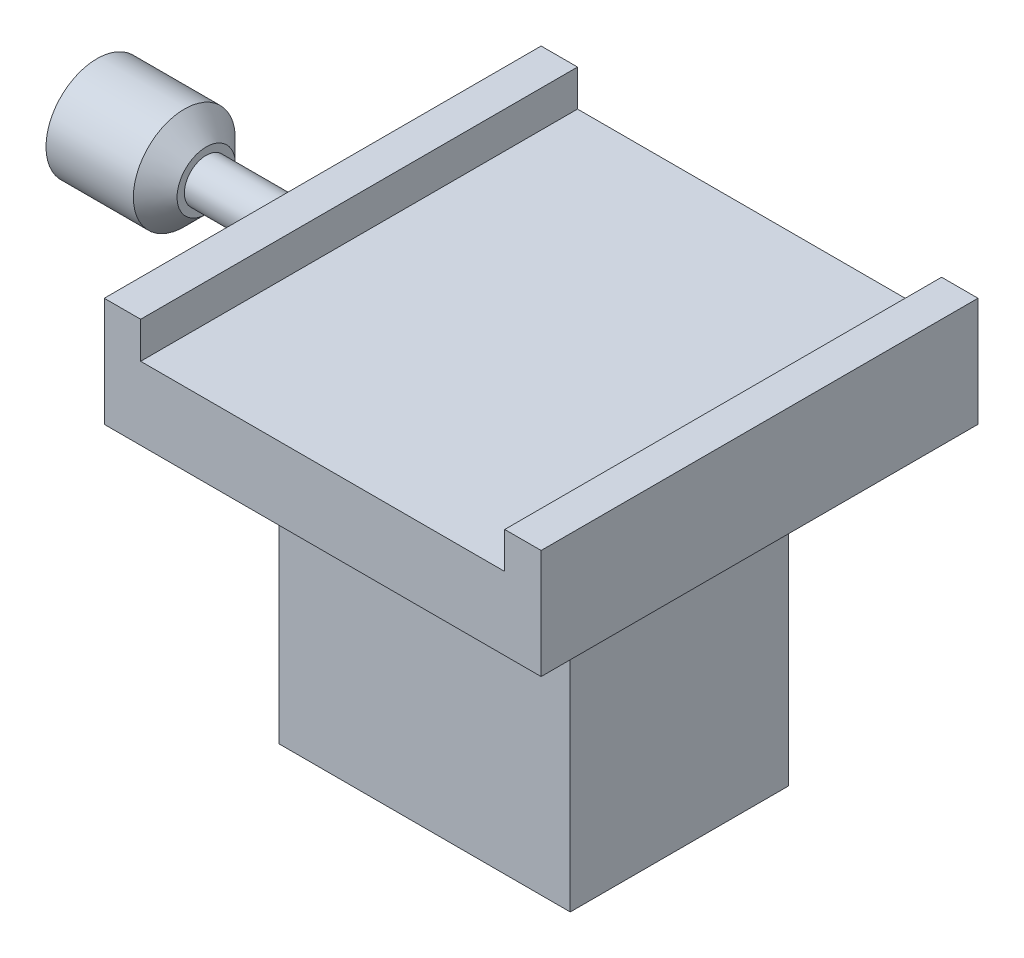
from build123d import *

# Parameters (mm, degrees)
SKETCH1_W           = 40
SKETCH1_H           = 30
BOSS_EXTRUDE1_DEPTH = 40
BOSS_EXTRUDE2_DEPTH = 29
BOSS_EXTRUDE3_DEPTH = 31
BOSS_EXTRUDE4_START = -55
SKETCH4_R           = 3
BOSS_EXTRUDE4_DEPTH = 35
SKETCH5_R           = 7
BOSS_EXTRUDE5_DEPTH = 15
CHAMFER1_SIZE       = 3


with BuildPart() as part:
    # Sketch1 → Boss-Extrude1 (new body)
    with BuildSketch(Plane(origin=(0, 0, 0), x_dir=(1, 0, 0), z_dir=(0, 1, 0))):
        Rectangle(SKETCH1_W, SKETCH1_H)
    extrude(amount=-BOSS_EXTRUDE1_DEPTH)

    # Sketch3 → Boss-Extrude2 (add)
    with BuildSketch(Plane.XY):
        Polygon((25, 15), (30, 15), (30, 0), (-30, 0), (-30, 15), (-25, 15), (-25, 10), (25, 10), align=None)
    extrude(amount=BOSS_EXTRUDE2_DEPTH)

    # Sketch3_2 → Boss-Extrude3 (add)
    with BuildSketch(Plane.XY):
        Polygon((25, 15), (30, 15), (30, 0), (-30, 0), (-30, 15), (-25, 15), (-25, 10), (25, 10), align=None)
    extrude(amount=-BOSS_EXTRUDE3_DEPTH)

    # Sketch4 → Boss-Extrude4 (add)
    with BuildSketch(Plane(origin=(30, 0, 0), x_dir=(0, 0, -1), z_dir=(1, 0, 0)).offset(BOSS_EXTRUDE4_START)):
        with Locations((0, 7)):
            Circle(SKETCH4_R)
    extrude(amount=-BOSS_EXTRUDE4_DEPTH)

    # Sketch5 → Boss-Extrude5 (add)
    with BuildSketch(Plane.ZY.offset(60)):
        with Locations((0, 7)):
            Circle(SKETCH5_R)
    extrude(amount=-BOSS_EXTRUDE5_DEPTH)

    # Chamfer1
    chamfer1_edges = [part.edges().sort_by_distance(p)[0] for p in [
        (-45, 7, -7),
    ]]
    chamfer(chamfer1_edges, length=CHAMFER1_SIZE)


solid = part.part
